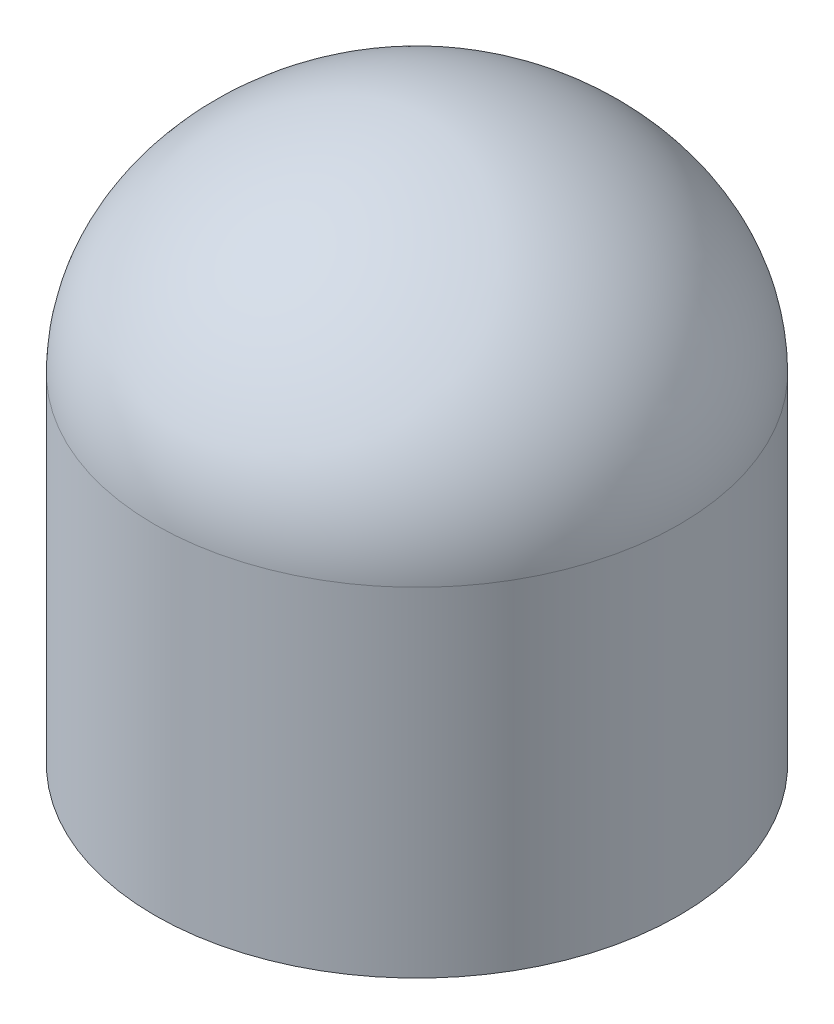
from build123d import *

# Parameters (mm, degrees)
ENL_V_MAT_EXTRU_1_DEPTH      = 367.304097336
ENL_V_MAT_EXTRU_1_DEPTH_BACK = 367.304097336
ESQUISSE4_W                  = 78.900272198
ESQUISSE4_H                  = 35.941866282


with BuildPart() as part:
    # Esquisse3 → R_volution1 (revolve)
    with BuildSketch(Plane.XY.offset(334.5), mode=Mode.PRIVATE) as r_volution1_sk:
        with BuildLine():
            Line((1.62311967, 80.150030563), (7.62311967, 83.614132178))
            Line((7.62311967, 83.614132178), (7.62311967, 90.150030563))
            add(Edge.make_bspline(
                [(-11.87688033, 73.631742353), (-11.87688033, 83.220288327), (-1.155782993, 90.150030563), (7.62311967, 90.150030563)],
                knots=[0, 0, 0, 0, 1, 1, 1, 1], degree=3))
            Line((-11.87688033, 73.631742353), (-11.87688033, 30.150030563))
            Line((-11.87688033, 30.150030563), (0.62311967, 30.150030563))
            Line((0.62311967, 30.150030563), (0.62311967, 80.150030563))
            Line((0.62311967, 80.150030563), (1.62311967, 80.150030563))
        make_face()
    revolve(r_volution1_sk.sketch.rotate(Axis((7.62311967, 83.614132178, 334.5), (0, 1, 0)), 270), axis=Axis((7.62311967, 83.614132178, 334.5), (0, 1, 0)))

    # Esquisse4 → Enl_v. mat.-Extru.1 (cut, two sides: drawn at the far end of the back side and taken through both)
    with BuildSketch(Plane.XY.offset(-ENL_V_MAT_EXTRU_1_DEPTH_BACK)):
        with Locations((9.532273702, 30.479097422)):
            Rectangle(ESQUISSE4_W, ESQUISSE4_H)
    extrude(amount=ENL_V_MAT_EXTRU_1_DEPTH + ENL_V_MAT_EXTRU_1_DEPTH_BACK, mode=Mode.SUBTRACT)


solid = part.part
